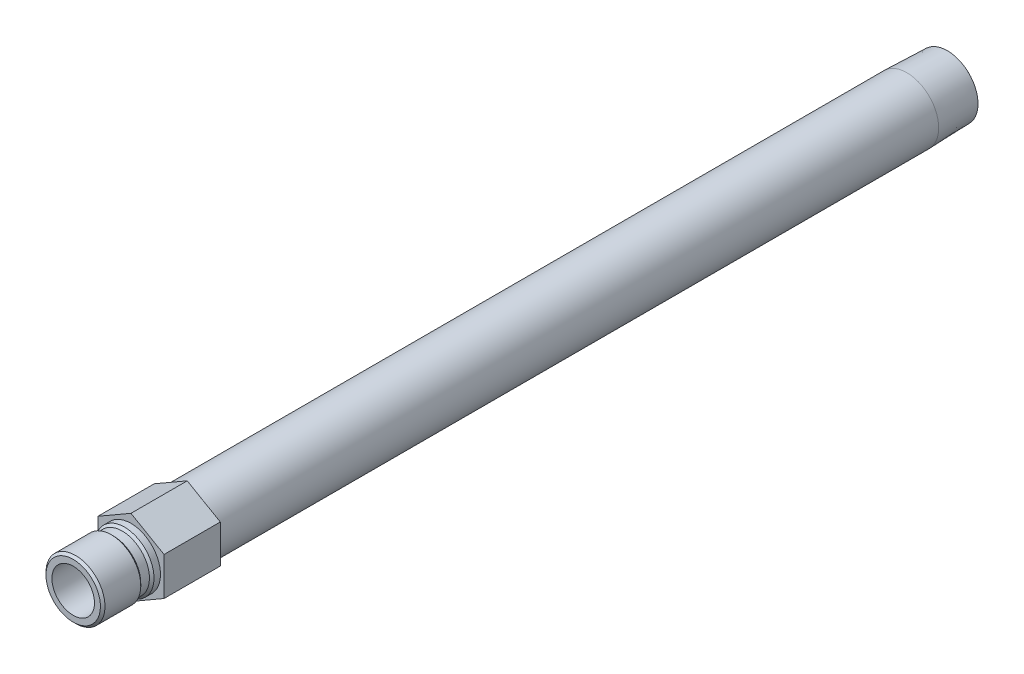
from build123d import *

# Parameters (mm, degrees)
SKETCH2_R           = 7.112
BOSS_EXTRUDE1_DEPTH = 18.796


with BuildPart() as part:
    # Sketch1 → Revolve1 (revolve)
    with BuildSketch(Plane(origin=(0, 0, 0), x_dir=(0, 0, -1), z_dir=(1, 0, 0))):
        Polygon((-19.304, 7.112), (-19.304, 9.0932), (-18.542, 9.8552), (-6.5786, 9.8552), (-5.8166, 9.0932), (-2.921, 9.0932), (-2.159, 9.8552), (0, 9.8552), (0, 10.668), (259.2324, 10.668), (272.796, 10.244140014), (272.796, 7.8994), (-1.105331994, 7.8994), (-1.524, 7.112), align=None)
    revolve(axis=Axis((0, 0, 0), (0, 0, 1)))

    # Sketch2 → Boss-Extrude1 (add)
    with BuildSketch(Plane.XY):
        Polygon((-11.049, 6.379143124), (-11.049, -6.379143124), (0, -12.758286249), (11.049, -6.379143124), (11.049, 6.379143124), (0, 12.758286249), align=None)
        with Locations(Location((0, 0, 0), (0, 0, 90))):
            Circle(SKETCH2_R, mode=Mode.SUBTRACT)
    extrude(amount=-BOSS_EXTRUDE1_DEPTH)


solid = part.part
